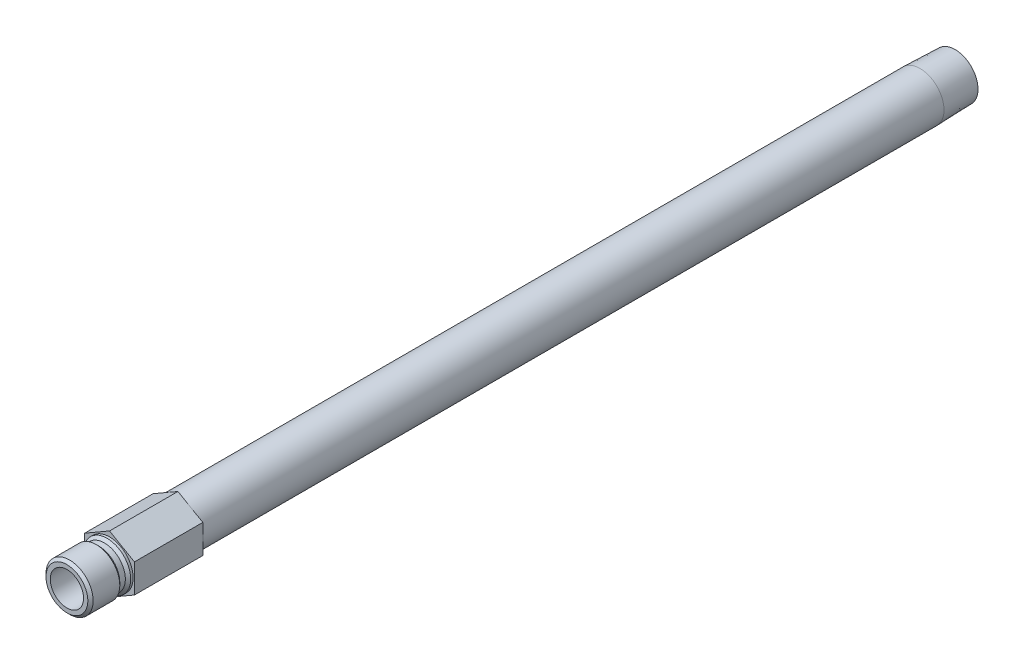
from build123d import *

# Parameters (mm, degrees)
SKETCH2_R           = 4.6228
BOSS_EXTRUDE1_DEPTH = 19.558


with BuildPart() as part:
    # Sketch1 → Revolve1 (revolve)
    with BuildSketch(Plane(origin=(0, 0, 0), x_dir=(0, 0, -1), z_dir=(1, 0, 0))):
        Polygon((-12.192, 4.7625), (-12.192, 5.9817), (-11.43, 6.7437), (-3.81, 6.7437), (-3.048, 5.9817), (-1.4605, 5.9817), (-0.6985, 6.7437), (0, 6.7437), (0, 6.858), (231.775, 6.858), (241.808, 6.544470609), (241.808, 4.6228), (0.074279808, 4.6228), (0, 4.7625), align=None)
    revolve(axis=Axis((0, 0, 0), (0, 0, 1)))

    # Sketch2 → Boss-Extrude1 (add)
    with BuildSketch(Plane.XY):
        Polygon((-7.112, 4.106115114), (-7.112, -4.106115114), (0, -8.212230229), (7.112, -4.106115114), (7.112, 4.106115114), (0, 8.212230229), align=None)
        with Locations(Location((0, 0, 0), (0, 0, 90))):
            Circle(SKETCH2_R, mode=Mode.SUBTRACT)
    extrude(amount=-BOSS_EXTRUDE1_DEPTH)


solid = part.part
